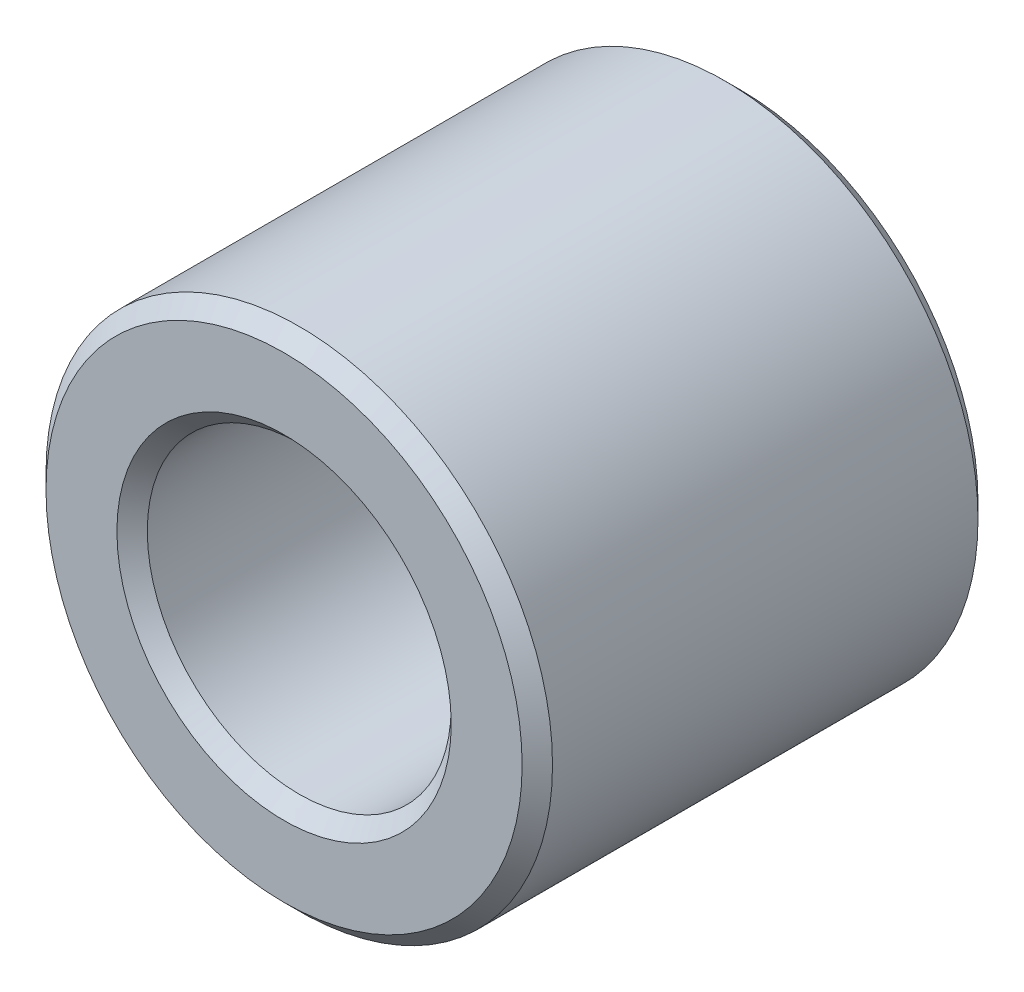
ISO-10303-21;
HEADER;
FILE_DESCRIPTION(('STEP AP214'),'2;1');
FILE_NAME('part.step','',(''),(''),'','','');
FILE_SCHEMA(('AUTOMOTIVE_DESIGN { 1 0 10303 214 1 1 1 1 }'));
ENDSEC;
DATA;
#1=APPLICATION_CONTEXT('core data for automotive mechanical design processes');
#2=APPLICATION_PROTOCOL_DEFINITION('international standard','automotive_design',2000,#1);
#3=PRODUCT_CONTEXT('',#1,'mechanical');
#4=PRODUCT('Part','Part','',(#3));
#5=PRODUCT_RELATED_PRODUCT_CATEGORY('part','',(#4));
#6=PRODUCT_DEFINITION_FORMATION('','',#4);
#7=PRODUCT_DEFINITION_CONTEXT('part definition',#1,'design');
#8=PRODUCT_DEFINITION('design','',#6,#7);
#9=PRODUCT_DEFINITION_SHAPE('','',#8);
#10=(LENGTH_UNIT() NAMED_UNIT(*) SI_UNIT(.MILLI.,.METRE.));
#11=(NAMED_UNIT(*) PLANE_ANGLE_UNIT() SI_UNIT($,.RADIAN.));
#12=(NAMED_UNIT(*) SI_UNIT($,.STERADIAN.) SOLID_ANGLE_UNIT());
#13=UNCERTAINTY_MEASURE_WITH_UNIT(LENGTH_MEASURE(1.E-05),#10,'distance_accuracy_value','');
#14=(GEOMETRIC_REPRESENTATION_CONTEXT(3) GLOBAL_UNCERTAINTY_ASSIGNED_CONTEXT((#13)) GLOBAL_UNIT_ASSIGNED_CONTEXT((#10,
#11,#12)) REPRESENTATION_CONTEXT('',''));
#15=CARTESIAN_POINT('',(0.,0.,0.));
#16=DIRECTION('',(0.,0.,1.));
#17=DIRECTION('',(1.,0.,0.));
#18=AXIS2_PLACEMENT_3D('',#15,#16,#17);
#19=CARTESIAN_POINT('',(0.,0.,45.));
#20=DIRECTION('',(0.,0.,1.));
#21=DIRECTION('',(1.,0.,0.));
#22=AXIS2_PLACEMENT_3D('',#19,#20,#21);
#23=PLANE('',#22);
#24=CARTESIAN_POINT('',(0.,0.,45.));
#25=DIRECTION('',(0.,0.,1.));
#26=DIRECTION('',(1.,0.,0.));
#27=AXIS2_PLACEMENT_3D('',#24,#25,#26);
#28=CIRCLE('',#27,33.0000000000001);
#29=CARTESIAN_POINT('',(33.0000000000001,0.,45.));
#30=VERTEX_POINT('',#29);
#31=EDGE_CURVE('E10',#30,#30,#28,.F.);
#32=ORIENTED_EDGE('',*,*,#31,.T.);
#33=EDGE_LOOP('',(#32));
#34=FACE_BOUND('',#33,.T.);
#35=CARTESIAN_POINT('',(0.,0.,45.));
#36=DIRECTION('',(0.,0.,1.));
#37=DIRECTION('',(1.,0.,0.));
#38=AXIS2_PLACEMENT_3D('',#35,#36,#37);
#39=CIRCLE('',#38,47.0000000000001);
#40=CARTESIAN_POINT('',(47.0000000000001,0.,45.));
#41=VERTEX_POINT('',#40);
#42=EDGE_CURVE('E45',#41,#41,#39,.T.);
#43=ORIENTED_EDGE('',*,*,#42,.T.);
#44=EDGE_LOOP('',(#43));
#45=FACE_BOUND('',#44,.T.);
#46=ADVANCED_FACE('F37',(#34,#45),#23,.T.);
#47=CARTESIAN_POINT('',(0.,0.,-45.));
#48=DIRECTION('',(0.,0.,1.));
#49=DIRECTION('',(1.,0.,0.));
#50=AXIS2_PLACEMENT_3D('',#47,#48,#49);
#51=PLANE('',#50);
#52=CARTESIAN_POINT('',(0.,0.,-45.));
#53=DIRECTION('',(0.,0.,1.));
#54=DIRECTION('',(1.,0.,0.));
#55=AXIS2_PLACEMENT_3D('',#52,#53,#54);
#56=CIRCLE('',#55,32.9999999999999);
#57=CARTESIAN_POINT('',(32.9999999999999,0.,-45.));
#58=VERTEX_POINT('',#57);
#59=EDGE_CURVE('E70',#58,#58,#56,.T.);
#60=ORIENTED_EDGE('',*,*,#59,.T.);
#61=EDGE_LOOP('',(#60));
#62=FACE_BOUND('',#61,.T.);
#63=CARTESIAN_POINT('',(0.,0.,-45.));
#64=DIRECTION('',(0.,0.,1.));
#65=DIRECTION('',(1.,0.,0.));
#66=AXIS2_PLACEMENT_3D('',#63,#64,#65);
#67=CIRCLE('',#66,46.9999999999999);
#68=CARTESIAN_POINT('',(46.9999999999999,0.,-45.));
#69=VERTEX_POINT('',#68);
#70=EDGE_CURVE('E73',#69,#69,#67,.F.);
#71=ORIENTED_EDGE('',*,*,#70,.T.);
#72=EDGE_LOOP('',(#71));
#73=FACE_BOUND('',#72,.T.);
#74=ADVANCED_FACE('F78',(#62,#73),#51,.F.);
#75=CARTESIAN_POINT('',(0.,0.,45.));
#76=DIRECTION('',(0.,0.,-1.));
#77=DIRECTION('',(-1.,0.,0.));
#78=AXIS2_PLACEMENT_3D('',#75,#76,#77);
#79=CYLINDRICAL_SURFACE('',#78,50.);
#80=CARTESIAN_POINT('',(0.,0.,-42.));
#81=DIRECTION('',(0.,0.,1.));
#82=DIRECTION('',(1.,0.,0.));
#83=AXIS2_PLACEMENT_3D('',#80,#81,#82);
#84=CIRCLE('',#83,50.);
#85=CARTESIAN_POINT('',(-50.,0.,-42.));
#86=VERTEX_POINT('',#85);
#87=EDGE_CURVE('E52',#86,#86,#84,.T.);
#88=CARTESIAN_POINT('',(0.,0.,42.0000000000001));
#89=DIRECTION('',(0.,0.,1.));
#90=DIRECTION('',(1.,0.,0.));
#91=AXIS2_PLACEMENT_3D('',#88,#89,#90);
#92=CIRCLE('',#91,50.);
#93=CARTESIAN_POINT('',(-50.,0.,42.0000000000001));
#94=VERTEX_POINT('',#93);
#95=EDGE_CURVE('E58',#94,#94,#92,.F.);
#96=CARTESIAN_POINT('',(-50.,0.,-42.));
#97=CARTESIAN_POINT('',(-50.,0.,-41.125));
#98=CARTESIAN_POINT('',(-50.,0.,-40.25));
#99=CARTESIAN_POINT('',(-50.,0.,-38.5));
#100=CARTESIAN_POINT('',(-50.,0.,-37.625));
#101=CARTESIAN_POINT('',(-50.,0.,-35.875));
#102=CARTESIAN_POINT('',(-50.,0.,-35.));
#103=CARTESIAN_POINT('',(-50.,0.,-33.2499999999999));
#104=CARTESIAN_POINT('',(-50.,0.,-32.3749999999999));
#105=CARTESIAN_POINT('',(-50.,0.,-30.6249999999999));
#106=CARTESIAN_POINT('',(-50.,0.,-29.7499999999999));
#107=CARTESIAN_POINT('',(-50.,0.,-27.9999999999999));
#108=CARTESIAN_POINT('',(-50.,0.,-27.1249999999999));
#109=CARTESIAN_POINT('',(-50.,0.,-25.3749999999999));
#110=CARTESIAN_POINT('',(-50.,0.,-24.4999999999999));
#111=CARTESIAN_POINT('',(-50.,0.,-22.7499999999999));
#112=CARTESIAN_POINT('',(-50.,0.,-21.8749999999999));
#113=CARTESIAN_POINT('',(-50.,0.,-20.1249999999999));
#114=CARTESIAN_POINT('',(-50.,0.,-19.2499999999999));
#115=CARTESIAN_POINT('',(-50.,0.,-17.4999999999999));
#116=CARTESIAN_POINT('',(-50.,0.,-16.6249999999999));
#117=CARTESIAN_POINT('',(-50.,0.,-14.8749999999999));
#118=CARTESIAN_POINT('',(-50.,0.,-13.9999999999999));
#119=CARTESIAN_POINT('',(-50.,0.,-12.2499999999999));
#120=CARTESIAN_POINT('',(-50.,0.,-11.3749999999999));
#121=CARTESIAN_POINT('',(-50.,0.,-9.62499999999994));
#122=CARTESIAN_POINT('',(-50.,0.,-8.74999999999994));
#123=CARTESIAN_POINT('',(-50.,0.,-6.99999999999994));
#124=CARTESIAN_POINT('',(-50.,0.,-6.12499999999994));
#125=CARTESIAN_POINT('',(-50.,0.,-4.37499999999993));
#126=CARTESIAN_POINT('',(-50.,0.,-3.49999999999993));
#127=CARTESIAN_POINT('',(-50.,0.,-1.74999999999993));
#128=CARTESIAN_POINT('',(-50.,0.,-0.874999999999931));
#129=CARTESIAN_POINT('',(-50.,0.,0.87500000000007));
#130=CARTESIAN_POINT('',(-50.,0.,1.75000000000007));
#131=CARTESIAN_POINT('',(-50.,0.,3.50000000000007));
#132=CARTESIAN_POINT('',(-50.,0.,4.37500000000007));
#133=CARTESIAN_POINT('',(-50.,0.,6.12500000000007));
#134=CARTESIAN_POINT('',(-50.,0.,7.00000000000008));
#135=CARTESIAN_POINT('',(-50.,0.,8.75000000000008));
#136=CARTESIAN_POINT('',(-50.,0.,9.62500000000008));
#137=CARTESIAN_POINT('',(-50.,0.,11.3750000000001));
#138=CARTESIAN_POINT('',(-50.,0.,12.2500000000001));
#139=CARTESIAN_POINT('',(-50.,0.,14.0000000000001));
#140=CARTESIAN_POINT('',(-50.,0.,14.8750000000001));
#141=CARTESIAN_POINT('',(-50.,0.,16.6250000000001));
#142=CARTESIAN_POINT('',(-50.,0.,17.5000000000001));
#143=CARTESIAN_POINT('',(-50.,0.,19.2500000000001));
#144=CARTESIAN_POINT('',(-50.,0.,20.1250000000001));
#145=CARTESIAN_POINT('',(-50.,0.,21.8750000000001));
#146=CARTESIAN_POINT('',(-50.,0.,22.7500000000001));
#147=CARTESIAN_POINT('',(-50.,0.,24.5000000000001));
#148=CARTESIAN_POINT('',(-50.,0.,25.3750000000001));
#149=CARTESIAN_POINT('',(-50.,0.,27.1250000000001));
#150=CARTESIAN_POINT('',(-50.,0.,28.0000000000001));
#151=CARTESIAN_POINT('',(-50.,0.,29.7500000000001));
#152=CARTESIAN_POINT('',(-50.,0.,30.6250000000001));
#153=CARTESIAN_POINT('',(-50.,0.,32.3750000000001));
#154=CARTESIAN_POINT('',(-50.,0.,33.2500000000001));
#155=CARTESIAN_POINT('',(-50.,0.,35.0000000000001));
#156=CARTESIAN_POINT('',(-50.,0.,35.8750000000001));
#157=CARTESIAN_POINT('',(-50.,0.,37.6250000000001));
#158=CARTESIAN_POINT('',(-50.,0.,38.5000000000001));
#159=CARTESIAN_POINT('',(-50.,0.,40.2500000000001));
#160=CARTESIAN_POINT('',(-50.,0.,41.1250000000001));
#161=CARTESIAN_POINT('',(-50.,0.,42.0000000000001));
#162=B_SPLINE_CURVE_WITH_KNOTS('',3,(#96,#97,#98,#99,#100,#101,#102,#103,#104,#105,#106,#107,
#108,#109,#110,#111,#112,#113,#114,#115,#116,#117,#118,#119,#120,#121,#122,#123,#124,#125,#126,
#127,#128,#129,#130,#131,#132,#133,#134,#135,#136,#137,#138,#139,#140,#141,#142,#143,#144,#145,
#146,#147,#148,#149,#150,#151,#152,#153,#154,#155,#156,#157,#158,#159,#160,#161),.UNSPECIFIED.,
.F.,.F.,(4,2,2,2,2,2,2,2,2,2,2,2,2,2,2,2,2,2,2,2,2,2,2,2,2,2,2,2,2,2,2,2,4),(0.,2.625,5.25,
7.87500000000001,10.5,13.125,15.75,18.375,21.,23.625,26.25,28.875,31.5,34.125,36.75,39.375,42.,
44.625,47.25,49.875,52.5,55.125,57.75,60.375,63.,65.625,68.25,70.875,73.5,76.125,78.75,81.375,
84.),.UNSPECIFIED.);
#163=EDGE_CURVE('BSEAM88',#86,#94,#162,.T.);
#164=ORIENTED_EDGE('',*,*,#87,.T.);
#165=ORIENTED_EDGE('',*,*,#95,.T.);
#166=ORIENTED_EDGE('',*,*,#163,.T.);
#167=ORIENTED_EDGE('',*,*,#163,.F.);
#168=EDGE_LOOP('',(#164,#166,#165,#167));
#169=FACE_BOUND('',#168,.T.);
#170=ADVANCED_FACE('F88',(#169),#79,.T.);
#171=CARTESIAN_POINT('',(0.,0.,45.));
#172=DIRECTION('',(0.,0.,-1.));
#173=DIRECTION('',(-1.,0.,0.));
#174=AXIS2_PLACEMENT_3D('',#171,#172,#173);
#175=CYLINDRICAL_SURFACE('',#174,30.);
#176=CARTESIAN_POINT('',(0.,0.,-42.));
#177=DIRECTION('',(0.,0.,1.));
#178=DIRECTION('',(1.,0.,0.));
#179=AXIS2_PLACEMENT_3D('',#176,#177,#178);
#180=CIRCLE('',#179,30.);
#181=CARTESIAN_POINT('',(-30.,0.,-42.0000000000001));
#182=VERTEX_POINT('',#181);
#183=EDGE_CURVE('E63',#182,#182,#180,.F.);
#184=CARTESIAN_POINT('',(0.,0.,42.));
#185=DIRECTION('',(0.,0.,1.));
#186=DIRECTION('',(1.,0.,0.));
#187=AXIS2_PLACEMENT_3D('',#184,#185,#186);
#188=CIRCLE('',#187,30.);
#189=CARTESIAN_POINT('',(-30.,0.,42.));
#190=VERTEX_POINT('',#189);
#191=EDGE_CURVE('E66',#190,#190,#188,.T.);
#192=CARTESIAN_POINT('',(-30.,0.,-42.0000000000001));
#193=CARTESIAN_POINT('',(-30.,0.,-41.1250000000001));
#194=CARTESIAN_POINT('',(-30.,0.,-40.2500000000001));
#195=CARTESIAN_POINT('',(-30.,0.,-38.5000000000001));
#196=CARTESIAN_POINT('',(-30.,0.,-37.6250000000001));
#197=CARTESIAN_POINT('',(-30.,0.,-35.8750000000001));
#198=CARTESIAN_POINT('',(-30.,0.,-35.0000000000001));
#199=CARTESIAN_POINT('',(-30.,0.,-33.2500000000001));
#200=CARTESIAN_POINT('',(-30.,0.,-32.3750000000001));
#201=CARTESIAN_POINT('',(-30.,0.,-30.6250000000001));
#202=CARTESIAN_POINT('',(-30.,0.,-29.7500000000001));
#203=CARTESIAN_POINT('',(-30.,0.,-28.0000000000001));
#204=CARTESIAN_POINT('',(-30.,0.,-27.1250000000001));
#205=CARTESIAN_POINT('',(-30.,0.,-25.3750000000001));
#206=CARTESIAN_POINT('',(-30.,0.,-24.5000000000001));
#207=CARTESIAN_POINT('',(-30.,0.,-22.7500000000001));
#208=CARTESIAN_POINT('',(-30.,0.,-21.8750000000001));
#209=CARTESIAN_POINT('',(-30.,0.,-20.1250000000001));
#210=CARTESIAN_POINT('',(-30.,0.,-19.2500000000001));
#211=CARTESIAN_POINT('',(-30.,0.,-17.5000000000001));
#212=CARTESIAN_POINT('',(-30.,0.,-16.6250000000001));
#213=CARTESIAN_POINT('',(-30.,0.,-14.8750000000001));
#214=CARTESIAN_POINT('',(-30.,0.,-14.0000000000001));
#215=CARTESIAN_POINT('',(-30.,0.,-12.2500000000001));
#216=CARTESIAN_POINT('',(-30.,0.,-11.3750000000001));
#217=CARTESIAN_POINT('',(-30.,0.,-9.62500000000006));
#218=CARTESIAN_POINT('',(-30.,0.,-8.75000000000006));
#219=CARTESIAN_POINT('',(-30.,0.,-7.00000000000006));
#220=CARTESIAN_POINT('',(-30.,0.,-6.12500000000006));
#221=CARTESIAN_POINT('',(-30.,0.,-4.37500000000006));
#222=CARTESIAN_POINT('',(-30.,0.,-3.50000000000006));
#223=CARTESIAN_POINT('',(-30.,0.,-1.75000000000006));
#224=CARTESIAN_POINT('',(-30.,0.,-0.875000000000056));
#225=CARTESIAN_POINT('',(-30.,0.,0.874999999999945));
#226=CARTESIAN_POINT('',(-30.,0.,1.74999999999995));
#227=CARTESIAN_POINT('',(-30.,0.,3.49999999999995));
#228=CARTESIAN_POINT('',(-30.,0.,4.37499999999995));
#229=CARTESIAN_POINT('',(-30.,0.,6.12499999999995));
#230=CARTESIAN_POINT('',(-30.,0.,6.99999999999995));
#231=CARTESIAN_POINT('',(-30.,0.,8.74999999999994));
#232=CARTESIAN_POINT('',(-30.,0.,9.62499999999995));
#233=CARTESIAN_POINT('',(-30.,0.,11.3749999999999));
#234=CARTESIAN_POINT('',(-30.,0.,12.2499999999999));
#235=CARTESIAN_POINT('',(-30.,0.,13.9999999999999));
#236=CARTESIAN_POINT('',(-30.,0.,14.8749999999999));
#237=CARTESIAN_POINT('',(-30.,0.,16.625));
#238=CARTESIAN_POINT('',(-30.,0.,17.5));
#239=CARTESIAN_POINT('',(-30.,0.,19.25));
#240=CARTESIAN_POINT('',(-30.,0.,20.125));
#241=CARTESIAN_POINT('',(-30.,0.,21.875));
#242=CARTESIAN_POINT('',(-30.,0.,22.75));
#243=CARTESIAN_POINT('',(-30.,0.,24.5));
#244=CARTESIAN_POINT('',(-30.,0.,25.375));
#245=CARTESIAN_POINT('',(-30.,0.,27.125));
#246=CARTESIAN_POINT('',(-30.,0.,28.));
#247=CARTESIAN_POINT('',(-30.,0.,29.7499999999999));
#248=CARTESIAN_POINT('',(-30.,0.,30.6249999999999));
#249=CARTESIAN_POINT('',(-30.,0.,32.3749999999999));
#250=CARTESIAN_POINT('',(-30.,0.,33.2499999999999));
#251=CARTESIAN_POINT('',(-30.,0.,35.));
#252=CARTESIAN_POINT('',(-30.,0.,35.875));
#253=CARTESIAN_POINT('',(-30.,0.,37.625));
#254=CARTESIAN_POINT('',(-30.,0.,38.5));
#255=CARTESIAN_POINT('',(-30.,0.,40.25));
#256=CARTESIAN_POINT('',(-30.,0.,41.125));
#257=CARTESIAN_POINT('',(-30.,0.,42.));
#258=B_SPLINE_CURVE_WITH_KNOTS('',3,(#192,#193,#194,#195,#196,#197,#198,#199,#200,#201,#202,
#203,#204,#205,#206,#207,#208,#209,#210,#211,#212,#213,#214,#215,#216,#217,#218,#219,#220,#221,
#222,#223,#224,#225,#226,#227,#228,#229,#230,#231,#232,#233,#234,#235,#236,#237,#238,#239,#240,
#241,#242,#243,#244,#245,#246,#247,#248,#249,#250,#251,#252,#253,#254,#255,#256,#257),
.UNSPECIFIED.,.F.,.F.,(4,2,2,2,2,2,2,2,2,2,2,2,2,2,2,2,2,2,2,2,2,2,2,2,2,2,2,2,2,2,2,2,4),(0.,
2.625,5.25,7.87500000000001,10.5,13.125,15.75,18.375,21.,23.625,26.25,28.875,31.5,34.125,36.75,
39.375,42.,44.625,47.25,49.875,52.5,55.125,57.75,60.375,63.,65.625,68.25,70.875,73.5,76.125,
78.75,81.375,84.),.UNSPECIFIED.);
#259=EDGE_CURVE('BSEAM91',#182,#190,#258,.T.);
#260=ORIENTED_EDGE('',*,*,#183,.T.);
#261=ORIENTED_EDGE('',*,*,#191,.T.);
#262=ORIENTED_EDGE('',*,*,#259,.T.);
#263=ORIENTED_EDGE('',*,*,#259,.F.);
#264=EDGE_LOOP('',(#260,#262,#261,#263));
#265=FACE_BOUND('',#264,.T.);
#266=ADVANCED_FACE('F91',(#265),#175,.F.);
#267=CARTESIAN_POINT('',(0.,0.,-45.));
#268=DIRECTION('',(0.,0.,-1.));
#269=DIRECTION('',(-1.,0.,0.));
#270=AXIS2_PLACEMENT_3D('',#267,#268,#269);
#271=CONICAL_SURFACE('',#270,32.9999999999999,0.785398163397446);
#272=ORIENTED_EDGE('',*,*,#183,.F.);
#273=EDGE_LOOP('',(#272));
#274=FACE_BOUND('',#273,.T.);
#275=ORIENTED_EDGE('',*,*,#59,.F.);
#276=EDGE_LOOP('',(#275));
#277=FACE_BOUND('',#276,.T.);
#278=ADVANCED_FACE('F84',(#274,#277),#271,.F.);
#279=CARTESIAN_POINT('',(0.,0.,-42.));
#280=DIRECTION('',(0.,0.,1.));
#281=DIRECTION('',(1.,0.,0.));
#282=AXIS2_PLACEMENT_3D('',#279,#280,#281);
#283=CONICAL_SURFACE('',#282,50.,0.785398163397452);
#284=ORIENTED_EDGE('',*,*,#70,.F.);
#285=EDGE_LOOP('',(#284));
#286=FACE_BOUND('',#285,.T.);
#287=ORIENTED_EDGE('',*,*,#87,.F.);
#288=EDGE_LOOP('',(#287));
#289=FACE_BOUND('',#288,.T.);
#290=ADVANCED_FACE('F80',(#286,#289),#283,.T.);
#291=CARTESIAN_POINT('',(0.,0.,42.));
#292=DIRECTION('',(0.,0.,1.));
#293=DIRECTION('',(1.,0.,0.));
#294=AXIS2_PLACEMENT_3D('',#291,#292,#293);
#295=CONICAL_SURFACE('',#294,30.,0.785398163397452);
#296=ORIENTED_EDGE('',*,*,#31,.F.);
#297=EDGE_LOOP('',(#296));
#298=FACE_BOUND('',#297,.T.);
#299=ORIENTED_EDGE('',*,*,#191,.F.);
#300=EDGE_LOOP('',(#299));
#301=FACE_BOUND('',#300,.T.);
#302=ADVANCED_FACE('F83',(#298,#301),#295,.F.);
#303=CARTESIAN_POINT('',(0.,0.,45.));
#304=DIRECTION('',(0.,0.,-1.));
#305=DIRECTION('',(-1.,0.,0.));
#306=AXIS2_PLACEMENT_3D('',#303,#304,#305);
#307=CONICAL_SURFACE('',#306,47.0000000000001,0.785398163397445);
#308=ORIENTED_EDGE('',*,*,#95,.F.);
#309=EDGE_LOOP('',(#308));
#310=FACE_BOUND('',#309,.T.);
#311=ORIENTED_EDGE('',*,*,#42,.F.);
#312=EDGE_LOOP('',(#311));
#313=FACE_BOUND('',#312,.T.);
#314=ADVANCED_FACE('F39',(#310,#313),#307,.T.);
#315=CLOSED_SHELL('',(#46,#74,#170,#266,#278,#290,#302,#314));
#316=MANIFOLD_SOLID_BREP('B2',#315);
#317=ADVANCED_BREP_SHAPE_REPRESENTATION('',(#18,#316),#14);
#318=SHAPE_DEFINITION_REPRESENTATION(#9,#317);
ENDSEC;
END-ISO-10303-21;
